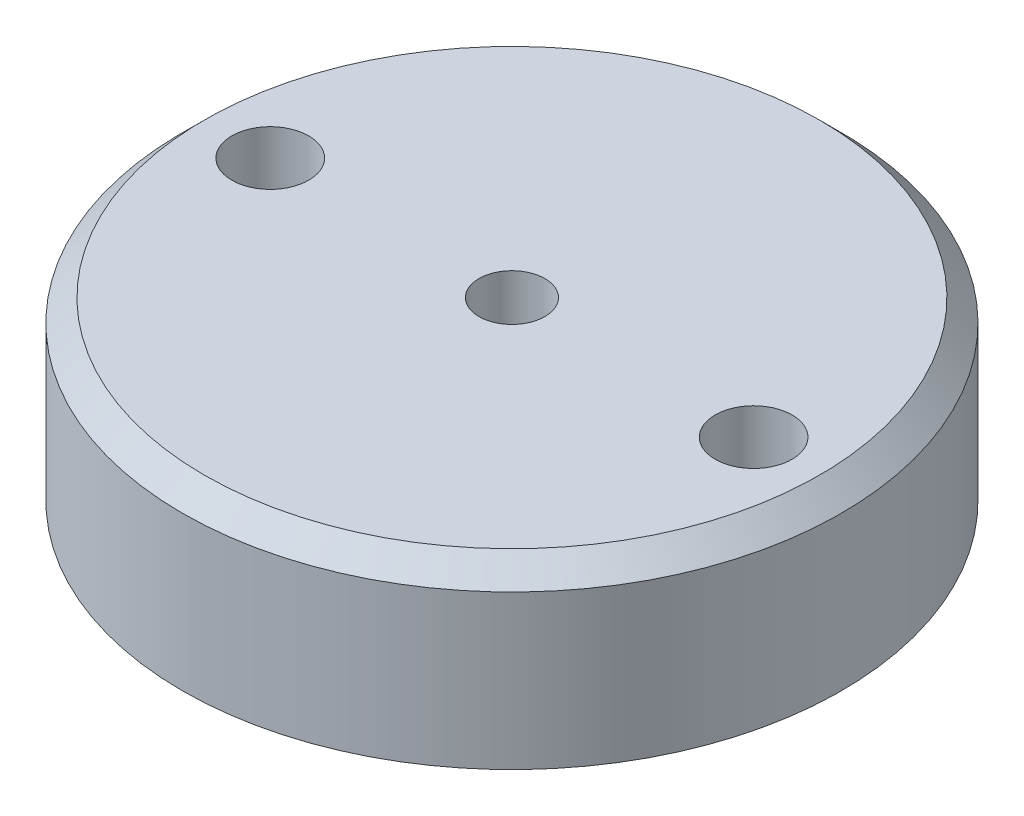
ISO-10303-21;
HEADER;
FILE_DESCRIPTION(('STEP AP214'),'2;1');
FILE_NAME('part.step','',(''),(''),'','','');
FILE_SCHEMA(('AUTOMOTIVE_DESIGN { 1 0 10303 214 1 1 1 1 }'));
ENDSEC;
DATA;
#1=APPLICATION_CONTEXT('core data for automotive mechanical design processes');
#2=APPLICATION_PROTOCOL_DEFINITION('international standard','automotive_design',2000,#1);
#3=PRODUCT_CONTEXT('',#1,'mechanical');
#4=PRODUCT('Part','Part','',(#3));
#5=PRODUCT_RELATED_PRODUCT_CATEGORY('part','',(#4));
#6=PRODUCT_DEFINITION_FORMATION('','',#4);
#7=PRODUCT_DEFINITION_CONTEXT('part definition',#1,'design');
#8=PRODUCT_DEFINITION('design','',#6,#7);
#9=PRODUCT_DEFINITION_SHAPE('','',#8);
#10=(LENGTH_UNIT() NAMED_UNIT(*) SI_UNIT(.MILLI.,.METRE.));
#11=(NAMED_UNIT(*) PLANE_ANGLE_UNIT() SI_UNIT($,.RADIAN.));
#12=(NAMED_UNIT(*) SI_UNIT($,.STERADIAN.) SOLID_ANGLE_UNIT());
#13=UNCERTAINTY_MEASURE_WITH_UNIT(LENGTH_MEASURE(1.E-05),#10,'distance_accuracy_value','');
#14=(GEOMETRIC_REPRESENTATION_CONTEXT(3) GLOBAL_UNCERTAINTY_ASSIGNED_CONTEXT((#13)) GLOBAL_UNIT_ASSIGNED_CONTEXT((#10,
#11,#12)) REPRESENTATION_CONTEXT('',''));
#15=CARTESIAN_POINT('',(0.,0.,0.));
#16=DIRECTION('',(0.,0.,1.));
#17=DIRECTION('',(1.,0.,0.));
#18=AXIS2_PLACEMENT_3D('',#15,#16,#17);
#19=CARTESIAN_POINT('',(0.,8.,0.));
#20=DIRECTION('',(0.,1.,0.));
#21=DIRECTION('',(0.,0.,1.));
#22=AXIS2_PLACEMENT_3D('',#19,#20,#21);
#23=PLANE('',#22);
#24=CARTESIAN_POINT('',(-11.,8.,0.));
#25=DIRECTION('',(0.,1.,0.));
#26=DIRECTION('',(0.,0.,1.));
#27=AXIS2_PLACEMENT_3D('',#24,#25,#26);
#28=CIRCLE('',#27,1.75);
#29=CARTESIAN_POINT('',(-11.,8.,1.75));
#30=VERTEX_POINT('',#29);
#31=EDGE_CURVE('E62',#30,#30,#28,.T.);
#32=ORIENTED_EDGE('',*,*,#31,.F.);
#33=EDGE_LOOP('',(#32));
#34=FACE_BOUND('',#33,.T.);
#35=CARTESIAN_POINT('',(11.,8.,0.));
#36=DIRECTION('',(0.,1.,0.));
#37=DIRECTION('',(0.,0.,1.));
#38=AXIS2_PLACEMENT_3D('',#35,#36,#37);
#39=CIRCLE('',#38,1.75);
#40=CARTESIAN_POINT('',(11.,8.,1.75));
#41=VERTEX_POINT('',#40);
#42=EDGE_CURVE('E56',#41,#41,#39,.T.);
#43=ORIENTED_EDGE('',*,*,#42,.F.);
#44=EDGE_LOOP('',(#43));
#45=FACE_BOUND('',#44,.T.);
#46=CARTESIAN_POINT('',(0.,8.,0.));
#47=DIRECTION('',(0.,1.,0.));
#48=DIRECTION('',(0.,0.,1.));
#49=AXIS2_PLACEMENT_3D('',#46,#47,#48);
#50=CIRCLE('',#49,14.);
#51=CARTESIAN_POINT('',(0.,8.,14.));
#52=VERTEX_POINT('',#51);
#53=EDGE_CURVE('E37',#52,#52,#50,.T.);
#54=ORIENTED_EDGE('',*,*,#53,.T.);
#55=EDGE_LOOP('',(#54));
#56=FACE_BOUND('',#55,.T.);
#57=CARTESIAN_POINT('',(0.,8.,0.));
#58=DIRECTION('',(0.,1.,0.));
#59=DIRECTION('',(0.,0.,1.));
#60=AXIS2_PLACEMENT_3D('',#57,#58,#59);
#61=CIRCLE('',#60,1.5);
#62=CARTESIAN_POINT('',(0.,8.,1.5));
#63=VERTEX_POINT('',#62);
#64=EDGE_CURVE('E45',#63,#63,#61,.T.);
#65=ORIENTED_EDGE('',*,*,#64,.F.);
#66=EDGE_LOOP('',(#65));
#67=FACE_BOUND('',#66,.T.);
#68=ADVANCED_FACE('F30',(#34,#45,#56,#67),#23,.T.);
#69=CARTESIAN_POINT('',(0.,0.,0.));
#70=DIRECTION('',(0.,1.,0.));
#71=DIRECTION('',(0.,0.,1.));
#72=AXIS2_PLACEMENT_3D('',#69,#70,#71);
#73=PLANE('',#72);
#74=CARTESIAN_POINT('',(-11.,0.,0.));
#75=DIRECTION('',(0.,1.,0.));
#76=DIRECTION('',(0.,0.,1.));
#77=AXIS2_PLACEMENT_3D('',#74,#75,#76);
#78=CIRCLE('',#77,1.75);
#79=CARTESIAN_POINT('',(-11.,0.,1.75));
#80=VERTEX_POINT('',#79);
#81=EDGE_CURVE('E59',#80,#80,#78,.T.);
#82=ORIENTED_EDGE('',*,*,#81,.T.);
#83=EDGE_LOOP('',(#82));
#84=FACE_BOUND('',#83,.T.);
#85=CARTESIAN_POINT('',(11.,0.,0.));
#86=DIRECTION('',(0.,1.,0.));
#87=DIRECTION('',(0.,0.,1.));
#88=AXIS2_PLACEMENT_3D('',#85,#86,#87);
#89=CIRCLE('',#88,1.75);
#90=CARTESIAN_POINT('',(11.,0.,1.75));
#91=VERTEX_POINT('',#90);
#92=EDGE_CURVE('E53',#91,#91,#89,.T.);
#93=ORIENTED_EDGE('',*,*,#92,.T.);
#94=EDGE_LOOP('',(#93));
#95=FACE_BOUND('',#94,.T.);
#96=CARTESIAN_POINT('',(0.,0.,0.));
#97=DIRECTION('',(0.,1.,0.));
#98=DIRECTION('',(0.,0.,1.));
#99=AXIS2_PLACEMENT_3D('',#96,#97,#98);
#100=CIRCLE('',#99,15.);
#101=CARTESIAN_POINT('',(0.,0.,15.));
#102=VERTEX_POINT('',#101);
#103=EDGE_CURVE('E41',#102,#102,#100,.T.);
#104=ORIENTED_EDGE('',*,*,#103,.F.);
#105=EDGE_LOOP('',(#104));
#106=FACE_BOUND('',#105,.T.);
#107=CARTESIAN_POINT('',(0.,0.,0.));
#108=DIRECTION('',(0.,1.,0.));
#109=DIRECTION('',(0.,0.,1.));
#110=AXIS2_PLACEMENT_3D('',#107,#108,#109);
#111=CIRCLE('',#110,1.5);
#112=CARTESIAN_POINT('',(0.,0.,1.5));
#113=VERTEX_POINT('',#112);
#114=EDGE_CURVE('E50',#113,#113,#111,.T.);
#115=ORIENTED_EDGE('',*,*,#114,.T.);
#116=EDGE_LOOP('',(#115));
#117=FACE_BOUND('',#116,.T.);
#118=ADVANCED_FACE('F70',(#84,#95,#106,#117),#73,.F.);
#119=CARTESIAN_POINT('',(0.,8.,0.));
#120=DIRECTION('',(0.,-1.,0.));
#121=DIRECTION('',(0.,0.,-1.));
#122=AXIS2_PLACEMENT_3D('',#119,#120,#121);
#123=CYLINDRICAL_SURFACE('',#122,15.);
#124=CARTESIAN_POINT('',(0.,7.,0.));
#125=DIRECTION('',(0.,1.,0.));
#126=DIRECTION('',(0.,0.,1.));
#127=AXIS2_PLACEMENT_3D('',#124,#125,#126);
#128=CIRCLE('',#127,15.);
#129=CARTESIAN_POINT('',(0.,7.,15.));
#130=VERTEX_POINT('',#129);
#131=EDGE_CURVE('E10',#130,#130,#128,.F.);
#132=ORIENTED_EDGE('',*,*,#131,.T.);
#133=EDGE_LOOP('',(#132));
#134=FACE_BOUND('',#133,.T.);
#135=ORIENTED_EDGE('',*,*,#103,.T.);
#136=EDGE_LOOP('',(#135));
#137=FACE_BOUND('',#136,.T.);
#138=ADVANCED_FACE('F32',(#134,#137),#123,.T.);
#139=CARTESIAN_POINT('',(0.,8.,0.));
#140=DIRECTION('',(0.,-1.,0.));
#141=DIRECTION('',(0.,0.,-1.));
#142=AXIS2_PLACEMENT_3D('',#139,#140,#141);
#143=CYLINDRICAL_SURFACE('',#142,1.5);
#144=ORIENTED_EDGE('',*,*,#64,.T.);
#145=EDGE_LOOP('',(#144));
#146=FACE_BOUND('',#145,.T.);
#147=ORIENTED_EDGE('',*,*,#114,.F.);
#148=EDGE_LOOP('',(#147));
#149=FACE_BOUND('',#148,.T.);
#150=ADVANCED_FACE('F75',(#146,#149),#143,.F.);
#151=CARTESIAN_POINT('',(0.,8.,0.));
#152=DIRECTION('',(0.,-1.,0.));
#153=DIRECTION('',(0.,0.,-1.));
#154=AXIS2_PLACEMENT_3D('',#151,#152,#153);
#155=CONICAL_SURFACE('',#154,14.,0.785398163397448);
#156=ORIENTED_EDGE('',*,*,#131,.F.);
#157=EDGE_LOOP('',(#156));
#158=FACE_BOUND('',#157,.T.);
#159=ORIENTED_EDGE('',*,*,#53,.F.);
#160=EDGE_LOOP('',(#159));
#161=FACE_BOUND('',#160,.T.);
#162=ADVANCED_FACE('F78',(#158,#161),#155,.T.);
#163=CARTESIAN_POINT('',(11.,0.,0.));
#164=DIRECTION('',(0.,1.,0.));
#165=DIRECTION('',(0.,0.,1.));
#166=AXIS2_PLACEMENT_3D('',#163,#164,#165);
#167=CYLINDRICAL_SURFACE('',#166,1.75);
#168=ORIENTED_EDGE('',*,*,#92,.F.);
#169=EDGE_LOOP('',(#168));
#170=FACE_BOUND('',#169,.T.);
#171=ORIENTED_EDGE('',*,*,#42,.T.);
#172=EDGE_LOOP('',(#171));
#173=FACE_BOUND('',#172,.T.);
#174=ADVANCED_FACE('F92',(#170,#173),#167,.F.);
#175=CARTESIAN_POINT('',(-11.,0.,0.));
#176=DIRECTION('',(0.,1.,0.));
#177=DIRECTION('',(0.,0.,1.));
#178=AXIS2_PLACEMENT_3D('',#175,#176,#177);
#179=CYLINDRICAL_SURFACE('',#178,1.75);
#180=ORIENTED_EDGE('',*,*,#81,.F.);
#181=EDGE_LOOP('',(#180));
#182=FACE_BOUND('',#181,.T.);
#183=ORIENTED_EDGE('',*,*,#31,.T.);
#184=EDGE_LOOP('',(#183));
#185=FACE_BOUND('',#184,.T.);
#186=ADVANCED_FACE('F66',(#182,#185),#179,.F.);
#187=CLOSED_SHELL('',(#68,#118,#138,#150,#162,#174,#186));
#188=MANIFOLD_SOLID_BREP('B2',#187);
#189=ADVANCED_BREP_SHAPE_REPRESENTATION('',(#18,#188),#14);
#190=SHAPE_DEFINITION_REPRESENTATION(#9,#189);
ENDSEC;
END-ISO-10303-21;
